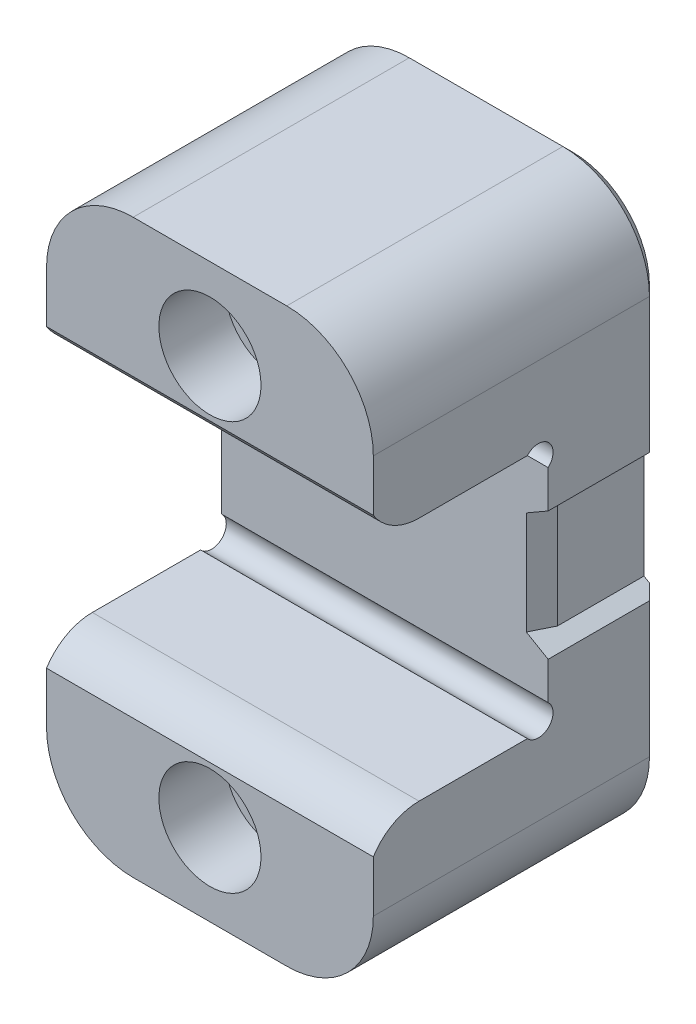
ISO-10303-21;
HEADER;
FILE_DESCRIPTION(('STEP AP214'),'2;1');
FILE_NAME('part.step','',(''),(''),'','','');
FILE_SCHEMA(('AUTOMOTIVE_DESIGN { 1 0 10303 214 1 1 1 1 }'));
ENDSEC;
DATA;
#1=APPLICATION_CONTEXT('core data for automotive mechanical design processes');
#2=APPLICATION_PROTOCOL_DEFINITION('international standard','automotive_design',2000,#1);
#3=PRODUCT_CONTEXT('',#1,'mechanical');
#4=PRODUCT('Part','Part','',(#3));
#5=PRODUCT_RELATED_PRODUCT_CATEGORY('part','',(#4));
#6=PRODUCT_DEFINITION_FORMATION('','',#4);
#7=PRODUCT_DEFINITION_CONTEXT('part definition',#1,'design');
#8=PRODUCT_DEFINITION('design','',#6,#7);
#9=PRODUCT_DEFINITION_SHAPE('','',#8);
#10=(LENGTH_UNIT() NAMED_UNIT(*) SI_UNIT(.MILLI.,.METRE.));
#11=(NAMED_UNIT(*) PLANE_ANGLE_UNIT() SI_UNIT($,.RADIAN.));
#12=(NAMED_UNIT(*) SI_UNIT($,.STERADIAN.) SOLID_ANGLE_UNIT());
#13=UNCERTAINTY_MEASURE_WITH_UNIT(LENGTH_MEASURE(1.E-05),#10,'distance_accuracy_value','');
#14=(GEOMETRIC_REPRESENTATION_CONTEXT(3) GLOBAL_UNCERTAINTY_ASSIGNED_CONTEXT((#13)) GLOBAL_UNIT_ASSIGNED_CONTEXT((#10,
#11,#12)) REPRESENTATION_CONTEXT('',''));
#15=CARTESIAN_POINT('',(0.,0.,0.));
#16=DIRECTION('',(0.,0.,1.));
#17=DIRECTION('',(1.,0.,0.));
#18=AXIS2_PLACEMENT_3D('',#15,#16,#17);
#19=CARTESIAN_POINT('',(25.4,44.45,0.));
#20=DIRECTION('',(0.,0.,-1.));
#21=DIRECTION('',(0.,1.,0.));
#22=AXIS2_PLACEMENT_3D('',#19,#20,#21);
#23=PLANE('',#22);
#24=DIRECTION('',(0.,-1.,0.));
#25=VECTOR('',#24,1.);
#26=CARTESIAN_POINT('',(-25.4,44.45,0.));
#27=LINE('',#26,#25);
#28=CARTESIAN_POINT('',(-25.4,30.988,0.));
#29=VERTEX_POINT('',#28);
#30=CARTESIAN_POINT('',(-25.4,22.995286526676,0.));
#31=VERTEX_POINT('',#30);
#32=EDGE_CURVE('E429',#29,#31,#27,.T.);
#33=ORIENTED_EDGE('',*,*,#32,.T.);
#34=DIRECTION('',(1.,0.,0.));
#35=VECTOR('',#34,1.);
#36=CARTESIAN_POINT('',(-25.4,22.995286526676,0.));
#37=LINE('',#36,#35);
#38=CARTESIAN_POINT('',(25.4,22.995286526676,0.));
#39=VERTEX_POINT('',#38);
#40=EDGE_CURVE('E398',#31,#39,#37,.T.);
#41=ORIENTED_EDGE('',*,*,#40,.T.);
#42=DIRECTION('',(0.,-1.,0.));
#43=VECTOR('',#42,1.);
#44=CARTESIAN_POINT('',(25.4,44.45,0.));
#45=LINE('',#44,#43);
#46=CARTESIAN_POINT('',(25.4,30.988,0.));
#47=VERTEX_POINT('',#46);
#48=EDGE_CURVE('E235',#47,#39,#45,.T.);
#49=ORIENTED_EDGE('',*,*,#48,.F.);
#50=CARTESIAN_POINT('',(11.938,30.988,0.));
#51=DIRECTION('',(0.,0.,-1.));
#52=DIRECTION('',(0.,1.,0.));
#53=AXIS2_PLACEMENT_3D('',#50,#51,#52);
#54=CIRCLE('',#53,13.462);
#55=CARTESIAN_POINT('',(11.938,44.45,0.));
#56=VERTEX_POINT('',#55);
#57=EDGE_CURVE('E265',#47,#56,#54,.F.);
#58=ORIENTED_EDGE('',*,*,#57,.T.);
#59=DIRECTION('',(-1.,0.,0.));
#60=VECTOR('',#59,1.);
#61=CARTESIAN_POINT('',(25.4,44.45,0.));
#62=LINE('',#61,#60);
#63=CARTESIAN_POINT('',(-11.938,44.45,0.));
#64=VERTEX_POINT('',#63);
#65=EDGE_CURVE('E241',#56,#64,#62,.T.);
#66=ORIENTED_EDGE('',*,*,#65,.T.);
#67=CARTESIAN_POINT('',(-11.938,30.988,0.));
#68=DIRECTION('',(0.,0.,-1.));
#69=DIRECTION('',(0.,1.,0.));
#70=AXIS2_PLACEMENT_3D('',#67,#68,#69);
#71=CIRCLE('',#70,13.462);
#72=EDGE_CURVE('E263',#64,#29,#71,.F.);
#73=ORIENTED_EDGE('',*,*,#72,.T.);
#74=EDGE_LOOP('',(#33,#41,#49,#58,#66,#73));
#75=FACE_BOUND('',#74,.T.);
#76=CARTESIAN_POINT('',(0.,31.75,0.));
#77=DIRECTION('',(0.,0.,1.));
#78=DIRECTION('',(1.,0.,0.));
#79=AXIS2_PLACEMENT_3D('',#76,#77,#78);
#80=CIRCLE('',#79,7.9375);
#81=CARTESIAN_POINT('',(7.9375,31.75,0.));
#82=VERTEX_POINT('',#81);
#83=EDGE_CURVE('E372',#82,#82,#80,.T.);
#84=ORIENTED_EDGE('',*,*,#83,.F.);
#85=EDGE_LOOP('',(#84));
#86=FACE_BOUND('',#85,.T.);
#87=ADVANCED_FACE('F32',(#75,#86),#23,.F.);
#88=CARTESIAN_POINT('',(25.4,19.05,-27.178));
#89=DIRECTION('',(0.,0.,-1.));
#90=DIRECTION('',(-1.,0.,0.));
#91=AXIS2_PLACEMENT_3D('',#88,#89,#90);
#92=PLANE('',#91);
#93=DIRECTION('',(0.866025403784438,-0.500000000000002,0.));
#94=VECTOR('',#93,1.);
#95=CARTESIAN_POINT('',(12.8282245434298,-2.72495383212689,-27.178));
#96=LINE('',#95,#94);
#97=CARTESIAN_POINT('',(21.9978635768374,-8.0190473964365,-27.178));
#98=VERTEX_POINT('',#97);
#99=CARTESIAN_POINT('',(25.4,-9.98327177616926,-27.178));
#100=VERTEX_POINT('',#99);
#101=EDGE_CURVE('E427',#98,#100,#96,.T.);
#102=ORIENTED_EDGE('',*,*,#101,.F.);
#103=DIRECTION('',(0.,1.,0.));
#104=VECTOR('',#103,1.);
#105=CARTESIAN_POINT('',(21.9978635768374,8.60845644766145,-27.178));
#106=LINE('',#105,#104);
#107=CARTESIAN_POINT('',(21.9978635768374,8.01904739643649,-27.178));
#108=VERTEX_POINT('',#107);
#109=EDGE_CURVE('E285',#98,#108,#106,.T.);
#110=ORIENTED_EDGE('',*,*,#109,.T.);
#111=DIRECTION('',(-0.866025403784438,-0.500000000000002,0.));
#112=VECTOR('',#111,1.);
#113=CARTESIAN_POINT('',(29.3260084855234,12.249953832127,-27.178));
#114=LINE('',#113,#112);
#115=CARTESIAN_POINT('',(25.4,9.98327177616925,-27.178));
#116=VERTEX_POINT('',#115);
#117=EDGE_CURVE('E425',#116,#108,#114,.T.);
#118=ORIENTED_EDGE('',*,*,#117,.F.);
#119=DIRECTION('',(0.,-1.,0.));
#120=VECTOR('',#119,1.);
#121=CARTESIAN_POINT('',(25.4,19.05,-27.178));
#122=LINE('',#121,#120);
#123=CARTESIAN_POINT('',(25.4,15.8221162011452,-27.178));
#124=VERTEX_POINT('',#123);
#125=EDGE_CURVE('E436',#124,#116,#122,.T.);
#126=ORIENTED_EDGE('',*,*,#125,.F.);
#127=DIRECTION('',(1.,0.,0.));
#128=VECTOR('',#127,1.);
#129=CARTESIAN_POINT('',(-25.4,15.8221162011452,-27.178));
#130=LINE('',#129,#128);
#131=CARTESIAN_POINT('',(-25.4,15.8221162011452,-27.178));
#132=VERTEX_POINT('',#131);
#133=EDGE_CURVE('E391',#124,#132,#130,.F.);
#134=ORIENTED_EDGE('',*,*,#133,.T.);
#135=DIRECTION('',(0.,-1.,0.));
#136=VECTOR('',#135,1.);
#137=CARTESIAN_POINT('',(-25.4,19.05,-27.178));
#138=LINE('',#137,#136);
#139=CARTESIAN_POINT('',(-25.4,-15.8221162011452,-27.178));
#140=VERTEX_POINT('',#139);
#141=EDGE_CURVE('E232',#132,#140,#138,.T.);
#142=ORIENTED_EDGE('',*,*,#141,.T.);
#143=DIRECTION('',(1.,0.,0.));
#144=VECTOR('',#143,1.);
#145=CARTESIAN_POINT('',(-25.4,-15.8221162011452,-27.178));
#146=LINE('',#145,#144);
#147=CARTESIAN_POINT('',(25.4,-15.8221162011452,-27.178));
#148=VERTEX_POINT('',#147);
#149=EDGE_CURVE('E212',#140,#148,#146,.T.);
#150=ORIENTED_EDGE('',*,*,#149,.T.);
#151=EDGE_CURVE('E435',#100,#148,#122,.T.);
#152=ORIENTED_EDGE('',*,*,#151,.F.);
#153=EDGE_LOOP('',(#102,#110,#118,#126,#134,#142,#150,#152));
#154=FACE_BOUND('',#153,.T.);
#155=ADVANCED_FACE('F455',(#154),#92,.F.);
#156=CARTESIAN_POINT('',(25.4,44.45,-44.45));
#157=DIRECTION('',(0.,0.,1.));
#158=DIRECTION('',(1.,0.,0.));
#159=AXIS2_PLACEMENT_3D('',#156,#157,#158);
#160=PLANE('',#159);
#161=DIRECTION('',(0.866025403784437,-0.500000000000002,0.));
#162=VECTOR('',#161,1.);
#163=CARTESIAN_POINT('',(23.01875,-8.60845644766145,-44.45));
#164=LINE('',#163,#162);
#165=CARTESIAN_POINT('',(23.01875,-8.60845644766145,-44.45));
#166=VERTEX_POINT('',#165);
#167=CARTESIAN_POINT('',(23.876,-9.10338996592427,-44.45));
#168=VERTEX_POINT('',#167);
#169=EDGE_CURVE('E415',#166,#168,#164,.T.);
#170=ORIENTED_EDGE('',*,*,#169,.T.);
#171=DIRECTION('',(0.,-1.,0.));
#172=VECTOR('',#171,1.);
#173=CARTESIAN_POINT('',(23.876,44.45,-44.45));
#174=LINE('',#173,#172);
#175=CARTESIAN_POINT('',(23.876,-30.988,-44.45));
#176=VERTEX_POINT('',#175);
#177=EDGE_CURVE('E314',#168,#176,#174,.T.);
#178=ORIENTED_EDGE('',*,*,#177,.T.);
#179=CARTESIAN_POINT('',(11.938,-30.988,-44.45));
#180=DIRECTION('',(0.,0.,1.));
#181=DIRECTION('',(1.,0.,0.));
#182=AXIS2_PLACEMENT_3D('',#179,#180,#181);
#183=CIRCLE('',#182,11.938);
#184=CARTESIAN_POINT('',(11.938,-42.926,-44.45));
#185=VERTEX_POINT('',#184);
#186=EDGE_CURVE('E310',#176,#185,#183,.F.);
#187=ORIENTED_EDGE('',*,*,#186,.T.);
#188=DIRECTION('',(-1.,0.,0.));
#189=VECTOR('',#188,1.);
#190=CARTESIAN_POINT('',(25.4,-42.926,-44.45));
#191=LINE('',#190,#189);
#192=CARTESIAN_POINT('',(-11.938,-42.926,-44.45));
#193=VERTEX_POINT('',#192);
#194=EDGE_CURVE('E306',#185,#193,#191,.T.);
#195=ORIENTED_EDGE('',*,*,#194,.T.);
#196=CARTESIAN_POINT('',(-11.938,-30.988,-44.45));
#197=DIRECTION('',(0.,0.,1.));
#198=DIRECTION('',(1.,0.,0.));
#199=AXIS2_PLACEMENT_3D('',#196,#197,#198);
#200=CIRCLE('',#199,11.938);
#201=CARTESIAN_POINT('',(-23.876,-30.988,-44.45));
#202=VERTEX_POINT('',#201);
#203=EDGE_CURVE('E304',#193,#202,#200,.F.);
#204=ORIENTED_EDGE('',*,*,#203,.T.);
#205=DIRECTION('',(0.,1.,0.));
#206=VECTOR('',#205,1.);
#207=CARTESIAN_POINT('',(-23.876,30.988,-44.45));
#208=LINE('',#207,#206);
#209=CARTESIAN_POINT('',(-23.876,30.988,-44.45));
#210=VERTEX_POINT('',#209);
#211=EDGE_CURVE('E300',#202,#210,#208,.T.);
#212=ORIENTED_EDGE('',*,*,#211,.T.);
#213=CARTESIAN_POINT('',(-11.938,30.988,-44.45));
#214=DIRECTION('',(0.,0.,1.));
#215=DIRECTION('',(1.,0.,0.));
#216=AXIS2_PLACEMENT_3D('',#213,#214,#215);
#217=CIRCLE('',#216,11.938);
#218=CARTESIAN_POINT('',(-11.938,42.926,-44.45));
#219=VERTEX_POINT('',#218);
#220=EDGE_CURVE('E298',#210,#219,#217,.F.);
#221=ORIENTED_EDGE('',*,*,#220,.T.);
#222=DIRECTION('',(1.,0.,0.));
#223=VECTOR('',#222,1.);
#224=CARTESIAN_POINT('',(25.4,42.926,-44.45));
#225=LINE('',#224,#223);
#226=CARTESIAN_POINT('',(11.938,42.926,-44.45));
#227=VERTEX_POINT('',#226);
#228=EDGE_CURVE('E302',#219,#227,#225,.T.);
#229=ORIENTED_EDGE('',*,*,#228,.T.);
#230=CARTESIAN_POINT('',(11.938,30.988,-44.45));
#231=DIRECTION('',(0.,0.,1.));
#232=DIRECTION('',(1.,0.,0.));
#233=AXIS2_PLACEMENT_3D('',#230,#231,#232);
#234=CIRCLE('',#233,11.938);
#235=CARTESIAN_POINT('',(23.876,30.988,-44.45));
#236=VERTEX_POINT('',#235);
#237=EDGE_CURVE('E308',#227,#236,#234,.F.);
#238=ORIENTED_EDGE('',*,*,#237,.T.);
#239=DIRECTION('',(0.,-1.,0.));
#240=VECTOR('',#239,1.);
#241=CARTESIAN_POINT('',(23.876,44.45,-44.45));
#242=LINE('',#241,#240);
#243=CARTESIAN_POINT('',(23.876,9.10338996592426,-44.45));
#244=VERTEX_POINT('',#243);
#245=EDGE_CURVE('E312',#236,#244,#242,.T.);
#246=ORIENTED_EDGE('',*,*,#245,.T.);
#247=DIRECTION('',(-0.866025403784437,-0.500000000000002,0.));
#248=VECTOR('',#247,1.);
#249=CARTESIAN_POINT('',(23.01875,8.60845644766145,-44.45));
#250=LINE('',#249,#248);
#251=CARTESIAN_POINT('',(23.01875,8.60845644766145,-44.45));
#252=VERTEX_POINT('',#251);
#253=EDGE_CURVE('E418',#244,#252,#250,.T.);
#254=ORIENTED_EDGE('',*,*,#253,.T.);
#255=DIRECTION('',(0.,-1.,0.));
#256=VECTOR('',#255,1.);
#257=CARTESIAN_POINT('',(23.01875,8.60845644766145,-44.45));
#258=LINE('',#257,#256);
#259=EDGE_CURVE('E411',#252,#166,#258,.T.);
#260=ORIENTED_EDGE('',*,*,#259,.T.);
#261=EDGE_LOOP('',(#170,#178,#187,#195,#204,#212,#221,#229,#238,#246,#254,#260));
#262=FACE_BOUND('',#261,.T.);
#263=CARTESIAN_POINT('',(0.,31.75,-44.45));
#264=DIRECTION('',(0.,0.,1.));
#265=DIRECTION('',(1.,0.,0.));
#266=AXIS2_PLACEMENT_3D('',#263,#264,#265);
#267=CIRCLE('',#266,5.35812999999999);
#268=CARTESIAN_POINT('',(5.35812999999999,31.75,-44.45));
#269=VERTEX_POINT('',#268);
#270=EDGE_CURVE('E359',#269,#269,#267,.T.);
#271=ORIENTED_EDGE('',*,*,#270,.T.);
#272=EDGE_LOOP('',(#271));
#273=FACE_BOUND('',#272,.T.);
#274=CARTESIAN_POINT('',(0.,-31.75,-44.45));
#275=DIRECTION('',(0.,0.,1.));
#276=DIRECTION('',(1.,0.,0.));
#277=AXIS2_PLACEMENT_3D('',#274,#275,#276);
#278=CIRCLE('',#277,5.35812999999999);
#279=CARTESIAN_POINT('',(5.35812999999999,-31.75,-44.45));
#280=VERTEX_POINT('',#279);
#281=EDGE_CURVE('E369',#280,#280,#278,.T.);
#282=ORIENTED_EDGE('',*,*,#281,.T.);
#283=EDGE_LOOP('',(#282));
#284=FACE_BOUND('',#283,.T.);
#285=ADVANCED_FACE('F550',(#262,#273,#284),#160,.F.);
#286=CARTESIAN_POINT('',(25.4,-19.05,0.));
#287=DIRECTION('',(-1.,0.,0.));
#288=DIRECTION('',(0.,0.,1.));
#289=AXIS2_PLACEMENT_3D('',#286,#287,#288);
#290=PLANE('',#289);
#291=DIRECTION('',(0.,0.,-1.));
#292=VECTOR('',#291,1.);
#293=CARTESIAN_POINT('',(25.4,-30.988,0.));
#294=LINE('',#293,#292);
#295=CARTESIAN_POINT('',(25.4,-30.988,0.));
#296=VERTEX_POINT('',#295);
#297=CARTESIAN_POINT('',(25.4,-30.988,-42.926));
#298=VERTEX_POINT('',#297);
#299=EDGE_CURVE('E250',#296,#298,#294,.T.);
#300=ORIENTED_EDGE('',*,*,#299,.T.);
#301=DIRECTION('',(0.,1.,0.));
#302=VECTOR('',#301,1.);
#303=CARTESIAN_POINT('',(25.4,-19.05,-42.926));
#304=LINE('',#303,#302);
#305=CARTESIAN_POINT('',(25.4,-9.98327177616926,-42.926));
#306=VERTEX_POINT('',#305);
#307=EDGE_CURVE('E293',#298,#306,#304,.T.);
#308=ORIENTED_EDGE('',*,*,#307,.T.);
#309=DIRECTION('',(0.,0.,-1.));
#310=VECTOR('',#309,1.);
#311=CARTESIAN_POINT('',(25.4,-9.98327177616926,0.));
#312=LINE('',#311,#310);
#313=EDGE_CURVE('E277',#100,#306,#312,.T.);
#314=ORIENTED_EDGE('',*,*,#313,.F.);
#315=ORIENTED_EDGE('',*,*,#151,.T.);
#316=CARTESIAN_POINT('',(25.4,-17.526,-25.654));
#317=DIRECTION('',(1.,0.,0.));
#318=DIRECTION('',(0.,0.,1.));
#319=AXIS2_PLACEMENT_3D('',#316,#317,#318);
#320=CIRCLE('',#319,2.286);
#321=CARTESIAN_POINT('',(25.4,-19.05,-23.9501162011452));
#322=VERTEX_POINT('',#321);
#323=EDGE_CURVE('E217',#322,#148,#320,.T.);
#324=ORIENTED_EDGE('',*,*,#323,.F.);
#325=DIRECTION('',(0.,0.,1.));
#326=VECTOR('',#325,1.);
#327=CARTESIAN_POINT('',(25.4,-19.05,-27.178));
#328=LINE('',#327,#326);
#329=CARTESIAN_POINT('',(25.4,-19.05,-7.11199999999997));
#330=VERTEX_POINT('',#329);
#331=EDGE_CURVE('E225',#322,#330,#328,.T.);
#332=ORIENTED_EDGE('',*,*,#331,.T.);
#333=CARTESIAN_POINT('',(25.4,-27.4328930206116,-7.11199999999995));
#334=DIRECTION('',(-1.,0.,0.));
#335=DIRECTION('',(0.,0.,1.));
#336=AXIS2_PLACEMENT_3D('',#333,#334,#335);
#337=CIRCLE('',#336,8.38289302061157);
#338=CARTESIAN_POINT('',(25.4,-22.995286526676,0.));
#339=VERTEX_POINT('',#338);
#340=EDGE_CURVE('E402',#339,#330,#337,.T.);
#341=ORIENTED_EDGE('',*,*,#340,.F.);
#342=DIRECTION('',(0.,-1.,0.));
#343=VECTOR('',#342,1.);
#344=CARTESIAN_POINT('',(25.4,-19.05,0.));
#345=LINE('',#344,#343);
#346=EDGE_CURVE('E245',#339,#296,#345,.T.);
#347=ORIENTED_EDGE('',*,*,#346,.T.);
#348=EDGE_LOOP('',(#300,#308,#314,#315,#324,#332,#341,#347));
#349=FACE_BOUND('',#348,.T.);
#350=ADVANCED_FACE('F523',(#349),#290,.F.);
#351=DIRECTION('',(0.,0.,1.));
#352=VECTOR('',#351,1.);
#353=CARTESIAN_POINT('',(25.4,9.98327177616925,0.));
#354=LINE('',#353,#352);
#355=CARTESIAN_POINT('',(25.4,9.98327177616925,-42.926));
#356=VERTEX_POINT('',#355);
#357=EDGE_CURVE('E275',#356,#116,#354,.T.);
#358=ORIENTED_EDGE('',*,*,#357,.F.);
#359=DIRECTION('',(0.,1.,0.));
#360=VECTOR('',#359,1.);
#361=CARTESIAN_POINT('',(25.4,-19.05,-42.926));
#362=LINE('',#361,#360);
#363=CARTESIAN_POINT('',(25.4,30.988,-42.926));
#364=VERTEX_POINT('',#363);
#365=EDGE_CURVE('E316',#356,#364,#362,.T.);
#366=ORIENTED_EDGE('',*,*,#365,.T.);
#367=DIRECTION('',(0.,0.,1.));
#368=VECTOR('',#367,1.);
#369=CARTESIAN_POINT('',(25.4,30.988,0.));
#370=LINE('',#369,#368);
#371=EDGE_CURVE('E248',#364,#47,#370,.T.);
#372=ORIENTED_EDGE('',*,*,#371,.T.);
#373=ORIENTED_EDGE('',*,*,#48,.T.);
#374=CARTESIAN_POINT('',(25.4,27.4328930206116,-7.11199999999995));
#375=DIRECTION('',(-1.,0.,0.));
#376=DIRECTION('',(0.,0.,-1.));
#377=AXIS2_PLACEMENT_3D('',#374,#375,#376);
#378=CIRCLE('',#377,8.38289302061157);
#379=CARTESIAN_POINT('',(25.4,19.05,-7.11199999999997));
#380=VERTEX_POINT('',#379);
#381=EDGE_CURVE('E394',#380,#39,#378,.T.);
#382=ORIENTED_EDGE('',*,*,#381,.F.);
#383=DIRECTION('',(0.,0.,-1.));
#384=VECTOR('',#383,1.);
#385=CARTESIAN_POINT('',(25.4,19.05,0.));
#386=LINE('',#385,#384);
#387=CARTESIAN_POINT('',(25.4,19.05,-23.9501162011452));
#388=VERTEX_POINT('',#387);
#389=EDGE_CURVE('E432',#380,#388,#386,.T.);
#390=ORIENTED_EDGE('',*,*,#389,.T.);
#391=CARTESIAN_POINT('',(25.4,17.526,-25.654));
#392=DIRECTION('',(1.,0.,0.));
#393=DIRECTION('',(0.,0.,-1.));
#394=AXIS2_PLACEMENT_3D('',#391,#392,#393);
#395=CIRCLE('',#394,2.286);
#396=EDGE_CURVE('E386',#124,#388,#395,.T.);
#397=ORIENTED_EDGE('',*,*,#396,.F.);
#398=ORIENTED_EDGE('',*,*,#125,.T.);
#399=EDGE_LOOP('',(#358,#366,#372,#373,#382,#390,#397,#398));
#400=FACE_BOUND('',#399,.T.);
#401=ADVANCED_FACE('F459',(#400),#290,.F.);
#402=CARTESIAN_POINT('',(25.4,19.05,0.));
#403=DIRECTION('',(0.,1.,0.));
#404=DIRECTION('',(0.,0.,1.));
#405=AXIS2_PLACEMENT_3D('',#402,#403,#404);
#406=PLANE('',#405);
#407=DIRECTION('',(0.,0.,-1.));
#408=VECTOR('',#407,1.);
#409=CARTESIAN_POINT('',(-25.4,19.05,0.));
#410=LINE('',#409,#408);
#411=CARTESIAN_POINT('',(-25.4,19.05,-7.11199999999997));
#412=VERTEX_POINT('',#411);
#413=CARTESIAN_POINT('',(-25.4,19.05,-23.9501162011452));
#414=VERTEX_POINT('',#413);
#415=EDGE_CURVE('E237',#412,#414,#410,.T.);
#416=ORIENTED_EDGE('',*,*,#415,.T.);
#417=DIRECTION('',(1.,0.,0.));
#418=VECTOR('',#417,1.);
#419=CARTESIAN_POINT('',(-25.4,19.05,-23.9501162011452));
#420=LINE('',#419,#418);
#421=EDGE_CURVE('E388',#414,#388,#420,.T.);
#422=ORIENTED_EDGE('',*,*,#421,.T.);
#423=ORIENTED_EDGE('',*,*,#389,.F.);
#424=DIRECTION('',(1.,0.,0.));
#425=VECTOR('',#424,1.);
#426=CARTESIAN_POINT('',(-25.4,19.05,-7.11199999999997));
#427=LINE('',#426,#425);
#428=EDGE_CURVE('E400',#412,#380,#427,.T.);
#429=ORIENTED_EDGE('',*,*,#428,.F.);
#430=EDGE_LOOP('',(#416,#422,#423,#429));
#431=FACE_BOUND('',#430,.T.);
#432=ADVANCED_FACE('F446',(#431),#406,.F.);
#433=CARTESIAN_POINT('',(25.4,-19.05,-27.178));
#434=DIRECTION('',(0.,-1.,0.));
#435=DIRECTION('',(0.,0.,-1.));
#436=AXIS2_PLACEMENT_3D('',#433,#434,#435);
#437=PLANE('',#436);
#438=ORIENTED_EDGE('',*,*,#331,.F.);
#439=DIRECTION('',(1.,0.,0.));
#440=VECTOR('',#439,1.);
#441=CARTESIAN_POINT('',(-25.4,-19.05,-23.9501162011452));
#442=LINE('',#441,#440);
#443=CARTESIAN_POINT('',(-25.4,-19.05,-23.9501162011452));
#444=VERTEX_POINT('',#443);
#445=EDGE_CURVE('E209',#322,#444,#442,.F.);
#446=ORIENTED_EDGE('',*,*,#445,.T.);
#447=DIRECTION('',(0.,0.,1.));
#448=VECTOR('',#447,1.);
#449=CARTESIAN_POINT('',(-25.4,-19.05,-27.178));
#450=LINE('',#449,#448);
#451=CARTESIAN_POINT('',(-25.4,-19.05,-7.11199999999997));
#452=VERTEX_POINT('',#451);
#453=EDGE_CURVE('E223',#444,#452,#450,.T.);
#454=ORIENTED_EDGE('',*,*,#453,.T.);
#455=DIRECTION('',(1.,0.,0.));
#456=VECTOR('',#455,1.);
#457=CARTESIAN_POINT('',(-25.4,-19.05,-7.11199999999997));
#458=LINE('',#457,#456);
#459=EDGE_CURVE('E406',#452,#330,#458,.T.);
#460=ORIENTED_EDGE('',*,*,#459,.T.);
#461=EDGE_LOOP('',(#438,#446,#454,#460));
#462=FACE_BOUND('',#461,.T.);
#463=ADVANCED_FACE('F221',(#462),#437,.F.);
#464=CARTESIAN_POINT('',(25.4,-19.05,0.));
#465=DIRECTION('',(0.,0.,-1.));
#466=DIRECTION('',(0.,1.,0.));
#467=AXIS2_PLACEMENT_3D('',#464,#465,#466);
#468=PLANE('',#467);
#469=CARTESIAN_POINT('',(0.,-31.75,0.));
#470=DIRECTION('',(0.,0.,1.));
#471=DIRECTION('',(1.,0.,0.));
#472=AXIS2_PLACEMENT_3D('',#469,#470,#471);
#473=CIRCLE('',#472,7.9375);
#474=CARTESIAN_POINT('',(7.9375,-31.75,0.));
#475=VERTEX_POINT('',#474);
#476=EDGE_CURVE('E378',#475,#475,#473,.T.);
#477=ORIENTED_EDGE('',*,*,#476,.F.);
#478=EDGE_LOOP('',(#477));
#479=FACE_BOUND('',#478,.T.);
#480=ORIENTED_EDGE('',*,*,#346,.F.);
#481=DIRECTION('',(1.,0.,0.));
#482=VECTOR('',#481,1.);
#483=CARTESIAN_POINT('',(-25.4,-22.995286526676,0.));
#484=LINE('',#483,#482);
#485=CARTESIAN_POINT('',(-25.4,-22.995286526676,0.));
#486=VERTEX_POINT('',#485);
#487=EDGE_CURVE('E409',#486,#339,#484,.T.);
#488=ORIENTED_EDGE('',*,*,#487,.F.);
#489=DIRECTION('',(0.,-1.,0.));
#490=VECTOR('',#489,1.);
#491=CARTESIAN_POINT('',(-25.4,-19.05,0.));
#492=LINE('',#491,#490);
#493=CARTESIAN_POINT('',(-25.4,-30.988,0.));
#494=VERTEX_POINT('',#493);
#495=EDGE_CURVE('E231',#486,#494,#492,.T.);
#496=ORIENTED_EDGE('',*,*,#495,.T.);
#497=CARTESIAN_POINT('',(-11.938,-30.988,0.));
#498=DIRECTION('',(0.,0.,-1.));
#499=DIRECTION('',(0.,1.,0.));
#500=AXIS2_PLACEMENT_3D('',#497,#498,#499);
#501=CIRCLE('',#500,13.462);
#502=CARTESIAN_POINT('',(-11.938,-44.45,0.));
#503=VERTEX_POINT('',#502);
#504=EDGE_CURVE('E258',#494,#503,#501,.F.);
#505=ORIENTED_EDGE('',*,*,#504,.T.);
#506=DIRECTION('',(-1.,0.,0.));
#507=VECTOR('',#506,1.);
#508=CARTESIAN_POINT('',(25.4,-44.45,0.));
#509=LINE('',#508,#507);
#510=CARTESIAN_POINT('',(11.938,-44.45,0.));
#511=VERTEX_POINT('',#510);
#512=EDGE_CURVE('E244',#511,#503,#509,.T.);
#513=ORIENTED_EDGE('',*,*,#512,.F.);
#514=CARTESIAN_POINT('',(11.938,-30.988,0.));
#515=DIRECTION('',(0.,0.,-1.));
#516=DIRECTION('',(0.,1.,0.));
#517=AXIS2_PLACEMENT_3D('',#514,#515,#516);
#518=CIRCLE('',#517,13.462);
#519=EDGE_CURVE('E260',#511,#296,#518,.F.);
#520=ORIENTED_EDGE('',*,*,#519,.T.);
#521=EDGE_LOOP('',(#480,#488,#496,#505,#513,#520));
#522=FACE_BOUND('',#521,.T.);
#523=ADVANCED_FACE('F497',(#479,#522),#468,.F.);
#524=CARTESIAN_POINT('',(25.4,-44.45,0.));
#525=DIRECTION('',(0.,1.,0.));
#526=DIRECTION('',(0.,0.,1.));
#527=AXIS2_PLACEMENT_3D('',#524,#525,#526);
#528=PLANE('',#527);
#529=DIRECTION('',(0.,0.,-1.));
#530=VECTOR('',#529,1.);
#531=CARTESIAN_POINT('',(-11.938,-44.45,-44.45));
#532=LINE('',#531,#530);
#533=CARTESIAN_POINT('',(-11.938,-44.45,-42.926));
#534=VERTEX_POINT('',#533);
#535=EDGE_CURVE('E253',#503,#534,#532,.T.);
#536=ORIENTED_EDGE('',*,*,#535,.T.);
#537=DIRECTION('',(1.,0.,0.));
#538=VECTOR('',#537,1.);
#539=CARTESIAN_POINT('',(25.4,-44.45,-42.926));
#540=LINE('',#539,#538);
#541=CARTESIAN_POINT('',(11.938,-44.45,-42.926));
#542=VERTEX_POINT('',#541);
#543=EDGE_CURVE('E324',#534,#542,#540,.T.);
#544=ORIENTED_EDGE('',*,*,#543,.T.);
#545=DIRECTION('',(0.,0.,-1.));
#546=VECTOR('',#545,1.);
#547=CARTESIAN_POINT('',(11.938,-44.45,0.));
#548=LINE('',#547,#546);
#549=EDGE_CURVE('E256',#542,#511,#548,.F.);
#550=ORIENTED_EDGE('',*,*,#549,.T.);
#551=ORIENTED_EDGE('',*,*,#512,.T.);
#552=EDGE_LOOP('',(#536,#544,#550,#551));
#553=FACE_BOUND('',#552,.T.);
#554=ADVANCED_FACE('F501',(#553),#528,.F.);
#555=CARTESIAN_POINT('',(25.4,44.45,0.));
#556=DIRECTION('',(0.,-1.,0.));
#557=DIRECTION('',(0.,0.,-1.));
#558=AXIS2_PLACEMENT_3D('',#555,#556,#557);
#559=PLANE('',#558);
#560=DIRECTION('',(0.,0.,1.));
#561=VECTOR('',#560,1.);
#562=CARTESIAN_POINT('',(11.938,44.45,0.));
#563=LINE('',#562,#561);
#564=CARTESIAN_POINT('',(11.938,44.45,-42.926));
#565=VERTEX_POINT('',#564);
#566=EDGE_CURVE('E269',#56,#565,#563,.F.);
#567=ORIENTED_EDGE('',*,*,#566,.T.);
#568=DIRECTION('',(-1.,0.,0.));
#569=VECTOR('',#568,1.);
#570=CARTESIAN_POINT('',(25.4,44.45,-42.926));
#571=LINE('',#570,#569);
#572=CARTESIAN_POINT('',(-11.938,44.45,-42.926));
#573=VERTEX_POINT('',#572);
#574=EDGE_CURVE('E55',#565,#573,#571,.T.);
#575=ORIENTED_EDGE('',*,*,#574,.T.);
#576=DIRECTION('',(0.,0.,1.));
#577=VECTOR('',#576,1.);
#578=CARTESIAN_POINT('',(-11.938,44.45,0.));
#579=LINE('',#578,#577);
#580=EDGE_CURVE('E267',#573,#64,#579,.T.);
#581=ORIENTED_EDGE('',*,*,#580,.T.);
#582=ORIENTED_EDGE('',*,*,#65,.F.);
#583=EDGE_LOOP('',(#567,#575,#581,#582));
#584=FACE_BOUND('',#583,.T.);
#585=ADVANCED_FACE('F474',(#584),#559,.F.);
#586=CARTESIAN_POINT('',(-25.4,-19.05,0.));
#587=DIRECTION('',(-1.,0.,0.));
#588=DIRECTION('',(0.,0.,1.));
#589=AXIS2_PLACEMENT_3D('',#586,#587,#588);
#590=PLANE('',#589);
#591=DIRECTION('',(0.,0.,1.));
#592=VECTOR('',#591,1.);
#593=CARTESIAN_POINT('',(-25.4,30.988,-44.45));
#594=LINE('',#593,#592);
#595=CARTESIAN_POINT('',(-25.4,30.988,-42.926));
#596=VERTEX_POINT('',#595);
#597=EDGE_CURVE('E271',#29,#596,#594,.F.);
#598=ORIENTED_EDGE('',*,*,#597,.T.);
#599=DIRECTION('',(0.,-1.,0.));
#600=VECTOR('',#599,1.);
#601=CARTESIAN_POINT('',(-25.4,-30.988,-42.926));
#602=LINE('',#601,#600);
#603=CARTESIAN_POINT('',(-25.4,-30.988,-42.926));
#604=VERTEX_POINT('',#603);
#605=EDGE_CURVE('E41',#596,#604,#602,.T.);
#606=ORIENTED_EDGE('',*,*,#605,.T.);
#607=DIRECTION('',(0.,0.,-1.));
#608=VECTOR('',#607,1.);
#609=CARTESIAN_POINT('',(-25.4,-30.988,0.));
#610=LINE('',#609,#608);
#611=EDGE_CURVE('E273',#604,#494,#610,.F.);
#612=ORIENTED_EDGE('',*,*,#611,.T.);
#613=ORIENTED_EDGE('',*,*,#495,.F.);
#614=CARTESIAN_POINT('',(-25.4,-27.4328930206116,-7.11199999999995));
#615=DIRECTION('',(-1.,0.,0.));
#616=DIRECTION('',(0.,0.,1.));
#617=AXIS2_PLACEMENT_3D('',#614,#615,#616);
#618=CIRCLE('',#617,8.38289302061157);
#619=EDGE_CURVE('E230',#486,#452,#618,.T.);
#620=ORIENTED_EDGE('',*,*,#619,.T.);
#621=ORIENTED_EDGE('',*,*,#453,.F.);
#622=CARTESIAN_POINT('',(-25.4,-17.526,-25.654));
#623=DIRECTION('',(1.,0.,0.));
#624=DIRECTION('',(0.,0.,1.));
#625=AXIS2_PLACEMENT_3D('',#622,#623,#624);
#626=CIRCLE('',#625,2.286);
#627=EDGE_CURVE('E206',#444,#140,#626,.T.);
#628=ORIENTED_EDGE('',*,*,#627,.T.);
#629=ORIENTED_EDGE('',*,*,#141,.F.);
#630=CARTESIAN_POINT('',(-25.4,17.526,-25.654));
#631=DIRECTION('',(-1.,0.,0.));
#632=DIRECTION('',(0.,0.,1.));
#633=AXIS2_PLACEMENT_3D('',#630,#631,#632);
#634=CIRCLE('',#633,2.286);
#635=EDGE_CURVE('E280',#414,#132,#634,.T.);
#636=ORIENTED_EDGE('',*,*,#635,.F.);
#637=ORIENTED_EDGE('',*,*,#415,.F.);
#638=CARTESIAN_POINT('',(-25.4,27.4328930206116,-7.11199999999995));
#639=DIRECTION('',(-1.,0.,0.));
#640=DIRECTION('',(0.,0.,-1.));
#641=AXIS2_PLACEMENT_3D('',#638,#639,#640);
#642=CIRCLE('',#641,8.38289302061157);
#643=EDGE_CURVE('E395',#412,#31,#642,.T.);
#644=ORIENTED_EDGE('',*,*,#643,.T.);
#645=ORIENTED_EDGE('',*,*,#32,.F.);
#646=EDGE_LOOP('',(#598,#606,#612,#613,#620,#621,#628,#629,#636,#637,#644,#645));
#647=FACE_BOUND('',#646,.T.);
#648=ADVANCED_FACE('F228',(#647),#590,.T.);
#649=CARTESIAN_POINT('',(11.938,-30.988,0.));
#650=DIRECTION('',(0.,0.,-1.));
#651=DIRECTION('',(-1.,0.,0.));
#652=AXIS2_PLACEMENT_3D('',#649,#650,#651);
#653=CYLINDRICAL_SURFACE('',#652,13.462);
#654=ORIENTED_EDGE('',*,*,#549,.F.);
#655=CARTESIAN_POINT('',(11.938,-30.988,-42.926));
#656=DIRECTION('',(0.,0.,1.));
#657=DIRECTION('',(1.,0.,0.));
#658=AXIS2_PLACEMENT_3D('',#655,#656,#657);
#659=CIRCLE('',#658,13.462);
#660=EDGE_CURVE('E320',#542,#298,#659,.T.);
#661=ORIENTED_EDGE('',*,*,#660,.T.);
#662=ORIENTED_EDGE('',*,*,#299,.F.);
#663=ORIENTED_EDGE('',*,*,#519,.F.);
#664=EDGE_LOOP('',(#654,#661,#662,#663));
#665=FACE_BOUND('',#664,.T.);
#666=ADVANCED_FACE('F507',(#665),#653,.T.);
#667=CARTESIAN_POINT('',(11.938,30.988,0.));
#668=DIRECTION('',(0.,0.,1.));
#669=DIRECTION('',(1.,0.,0.));
#670=AXIS2_PLACEMENT_3D('',#667,#668,#669);
#671=CYLINDRICAL_SURFACE('',#670,13.462);
#672=ORIENTED_EDGE('',*,*,#371,.F.);
#673=CARTESIAN_POINT('',(11.938,30.988,-42.926));
#674=DIRECTION('',(0.,0.,1.));
#675=DIRECTION('',(1.,0.,0.));
#676=AXIS2_PLACEMENT_3D('',#673,#674,#675);
#677=CIRCLE('',#676,13.462);
#678=EDGE_CURVE('E322',#364,#565,#677,.T.);
#679=ORIENTED_EDGE('',*,*,#678,.T.);
#680=ORIENTED_EDGE('',*,*,#566,.F.);
#681=ORIENTED_EDGE('',*,*,#57,.F.);
#682=EDGE_LOOP('',(#672,#679,#680,#681));
#683=FACE_BOUND('',#682,.T.);
#684=ADVANCED_FACE('F477',(#683),#671,.T.);
#685=CARTESIAN_POINT('',(-11.938,-30.988,0.));
#686=DIRECTION('',(0.,0.,1.));
#687=DIRECTION('',(1.,0.,0.));
#688=AXIS2_PLACEMENT_3D('',#685,#686,#687);
#689=CYLINDRICAL_SURFACE('',#688,13.462);
#690=ORIENTED_EDGE('',*,*,#611,.F.);
#691=CARTESIAN_POINT('',(-11.938,-30.988,-42.926));
#692=DIRECTION('',(0.,0.,1.));
#693=DIRECTION('',(1.,0.,0.));
#694=AXIS2_PLACEMENT_3D('',#691,#692,#693);
#695=CIRCLE('',#694,13.462);
#696=EDGE_CURVE('E326',#604,#534,#695,.T.);
#697=ORIENTED_EDGE('',*,*,#696,.T.);
#698=ORIENTED_EDGE('',*,*,#535,.F.);
#699=ORIENTED_EDGE('',*,*,#504,.F.);
#700=EDGE_LOOP('',(#690,#697,#698,#699));
#701=FACE_BOUND('',#700,.T.);
#702=ADVANCED_FACE('F492',(#701),#689,.T.);
#703=CARTESIAN_POINT('',(-11.938,30.988,0.));
#704=DIRECTION('',(0.,0.,-1.));
#705=DIRECTION('',(-1.,0.,0.));
#706=AXIS2_PLACEMENT_3D('',#703,#704,#705);
#707=CYLINDRICAL_SURFACE('',#706,13.462);
#708=ORIENTED_EDGE('',*,*,#580,.F.);
#709=CARTESIAN_POINT('',(-11.938,30.988,-42.926));
#710=DIRECTION('',(0.,0.,1.));
#711=DIRECTION('',(1.,0.,0.));
#712=AXIS2_PLACEMENT_3D('',#709,#710,#711);
#713=CIRCLE('',#712,13.462);
#714=EDGE_CURVE('E11',#573,#596,#713,.T.);
#715=ORIENTED_EDGE('',*,*,#714,.T.);
#716=ORIENTED_EDGE('',*,*,#597,.F.);
#717=ORIENTED_EDGE('',*,*,#72,.F.);
#718=EDGE_LOOP('',(#708,#715,#716,#717));
#719=FACE_BOUND('',#718,.T.);
#720=ADVANCED_FACE('F469',(#719),#707,.T.);
#721=CARTESIAN_POINT('',(23.01875,8.60845644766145,0.));
#722=DIRECTION('',(1.,0.,0.));
#723=DIRECTION('',(0.,0.,-1.));
#724=AXIS2_PLACEMENT_3D('',#721,#722,#723);
#725=PLANE('',#724);
#726=DIRECTION('',(0.,0.,-1.));
#727=VECTOR('',#726,1.);
#728=CARTESIAN_POINT('',(23.01875,8.60845644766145,0.));
#729=LINE('',#728,#727);
#730=CARTESIAN_POINT('',(23.01875,8.60845644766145,-30.9880000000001));
#731=VERTEX_POINT('',#730);
#732=EDGE_CURVE('E420',#731,#252,#729,.T.);
#733=ORIENTED_EDGE('',*,*,#732,.F.);
#734=DIRECTION('',(0.,-1.,0.));
#735=VECTOR('',#734,1.);
#736=CARTESIAN_POINT('',(23.01875,-8.60845644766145,-30.9880000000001));
#737=LINE('',#736,#735);
#738=CARTESIAN_POINT('',(23.01875,-8.60845644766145,-30.9880000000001));
#739=VERTEX_POINT('',#738);
#740=EDGE_CURVE('E282',#731,#739,#737,.T.);
#741=ORIENTED_EDGE('',*,*,#740,.T.);
#742=DIRECTION('',(0.,0.,-1.));
#743=VECTOR('',#742,1.);
#744=CARTESIAN_POINT('',(23.01875,-8.60845644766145,0.));
#745=LINE('',#744,#743);
#746=EDGE_CURVE('E423',#739,#166,#745,.T.);
#747=ORIENTED_EDGE('',*,*,#746,.T.);
#748=ORIENTED_EDGE('',*,*,#259,.F.);
#749=EDGE_LOOP('',(#733,#741,#747,#748));
#750=FACE_BOUND('',#749,.T.);
#751=ADVANCED_FACE('F562',(#750),#725,.T.);
#752=CARTESIAN_POINT('',(23.01875,-8.60845644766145,0.));
#753=DIRECTION('',(0.500000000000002,0.866025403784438,0.));
#754=DIRECTION('',(-0.866025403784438,0.500000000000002,0.));
#755=AXIS2_PLACEMENT_3D('',#752,#753,#754);
#756=PLANE('',#755);
#757=ORIENTED_EDGE('',*,*,#313,.T.);
#758=DIRECTION('',(0.654653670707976,-0.377964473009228,0.654653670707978));
#759=VECTOR('',#758,1.);
#760=CARTESIAN_POINT('',(42.4361428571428,-19.8190934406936,-25.8898571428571));
#761=LINE('',#760,#759);
#762=EDGE_CURVE('E296',#306,#168,#761,.F.);
#763=ORIENTED_EDGE('',*,*,#762,.T.);
#764=ORIENTED_EDGE('',*,*,#169,.F.);
#765=ORIENTED_EDGE('',*,*,#746,.F.);
#766=DIRECTION('',(-0.255976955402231,0.14778836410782,0.955319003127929));
#767=VECTOR('',#766,1.);
#768=CARTESIAN_POINT('',(22.3674270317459,-8.23241495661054,-28.557229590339));
#769=LINE('',#768,#767);
#770=EDGE_CURVE('E288',#739,#98,#769,.T.);
#771=ORIENTED_EDGE('',*,*,#770,.T.);
#772=ORIENTED_EDGE('',*,*,#101,.T.);
#773=EDGE_LOOP('',(#757,#763,#764,#765,#771,#772));
#774=FACE_BOUND('',#773,.T.);
#775=ADVANCED_FACE('F527',(#774),#756,.T.);
#776=CARTESIAN_POINT('',(23.01875,8.60845644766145,0.));
#777=DIRECTION('',(0.500000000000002,-0.866025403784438,0.));
#778=DIRECTION('',(0.866025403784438,0.500000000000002,0.));
#779=AXIS2_PLACEMENT_3D('',#776,#777,#778);
#780=PLANE('',#779);
#781=ORIENTED_EDGE('',*,*,#253,.F.);
#782=DIRECTION('',(-0.654653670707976,-0.377964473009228,-0.654653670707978));
#783=VECTOR('',#782,1.);
#784=CARTESIAN_POINT('',(42.4361428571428,19.8190934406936,-25.8898571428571));
#785=LINE('',#784,#783);
#786=EDGE_CURVE('E318',#244,#356,#785,.F.);
#787=ORIENTED_EDGE('',*,*,#786,.T.);
#788=ORIENTED_EDGE('',*,*,#357,.T.);
#789=ORIENTED_EDGE('',*,*,#117,.T.);
#790=DIRECTION('',(0.255976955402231,0.14778836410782,-0.955319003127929));
#791=VECTOR('',#790,1.);
#792=CARTESIAN_POINT('',(23.01875,8.60845644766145,-30.9880000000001));
#793=LINE('',#792,#791);
#794=EDGE_CURVE('E291',#108,#731,#793,.T.);
#795=ORIENTED_EDGE('',*,*,#794,.T.);
#796=ORIENTED_EDGE('',*,*,#732,.T.);
#797=EDGE_LOOP('',(#781,#787,#788,#789,#795,#796));
#798=FACE_BOUND('',#797,.T.);
#799=ADVANCED_FACE('F536',(#798),#780,.T.);
#800=CARTESIAN_POINT('',(-25.4,-27.4328930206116,-7.11199999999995));
#801=DIRECTION('',(1.,0.,0.));
#802=DIRECTION('',(0.,0.,-1.));
#803=AXIS2_PLACEMENT_3D('',#800,#801,#802);
#804=CYLINDRICAL_SURFACE('',#803,8.38289302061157);
#805=ORIENTED_EDGE('',*,*,#340,.T.);
#806=ORIENTED_EDGE('',*,*,#459,.F.);
#807=ORIENTED_EDGE('',*,*,#619,.F.);
#808=ORIENTED_EDGE('',*,*,#487,.T.);
#809=EDGE_LOOP('',(#805,#806,#807,#808));
#810=FACE_BOUND('',#809,.T.);
#811=ADVANCED_FACE('F534',(#810),#804,.T.);
#812=CARTESIAN_POINT('',(-25.4,27.4328930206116,-7.11199999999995));
#813=DIRECTION('',(1.,0.,0.));
#814=DIRECTION('',(0.,0.,-1.));
#815=AXIS2_PLACEMENT_3D('',#812,#813,#814);
#816=CYLINDRICAL_SURFACE('',#815,8.38289302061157);
#817=ORIENTED_EDGE('',*,*,#381,.T.);
#818=ORIENTED_EDGE('',*,*,#40,.F.);
#819=ORIENTED_EDGE('',*,*,#643,.F.);
#820=ORIENTED_EDGE('',*,*,#428,.T.);
#821=EDGE_LOOP('',(#817,#818,#819,#820));
#822=FACE_BOUND('',#821,.T.);
#823=ADVANCED_FACE('F464',(#822),#816,.T.);
#824=CARTESIAN_POINT('',(-25.4,17.526,-25.654));
#825=DIRECTION('',(1.,0.,0.));
#826=DIRECTION('',(0.,0.,-1.));
#827=AXIS2_PLACEMENT_3D('',#824,#825,#826);
#828=CYLINDRICAL_SURFACE('',#827,2.286);
#829=ORIENTED_EDGE('',*,*,#396,.T.);
#830=ORIENTED_EDGE('',*,*,#421,.F.);
#831=ORIENTED_EDGE('',*,*,#635,.T.);
#832=ORIENTED_EDGE('',*,*,#133,.F.);
#833=EDGE_LOOP('',(#829,#830,#831,#832));
#834=FACE_BOUND('',#833,.T.);
#835=ADVANCED_FACE('F451',(#834),#828,.F.);
#836=CARTESIAN_POINT('',(-25.4,-17.526,-25.654));
#837=DIRECTION('',(1.,0.,0.));
#838=DIRECTION('',(0.,0.,-1.));
#839=AXIS2_PLACEMENT_3D('',#836,#837,#838);
#840=CYLINDRICAL_SURFACE('',#839,2.286);
#841=ORIENTED_EDGE('',*,*,#627,.F.);
#842=ORIENTED_EDGE('',*,*,#445,.F.);
#843=ORIENTED_EDGE('',*,*,#323,.T.);
#844=ORIENTED_EDGE('',*,*,#149,.F.);
#845=EDGE_LOOP('',(#841,#842,#843,#844));
#846=FACE_BOUND('',#845,.T.);
#847=ADVANCED_FACE('F208',(#846),#840,.F.);
#848=CARTESIAN_POINT('',(4.7625,-31.75,-10.32002));
#849=DIRECTION('',(0.,0.,-1.));
#850=DIRECTION('',(-1.,0.,0.));
#851=AXIS2_PLACEMENT_3D('',#848,#849,#850);
#852=PLANE('',#851);
#853=CARTESIAN_POINT('',(0.,-31.75,-10.32002));
#854=DIRECTION('',(0.,0.,1.));
#855=DIRECTION('',(1.,0.,0.));
#856=AXIS2_PLACEMENT_3D('',#853,#854,#855);
#857=CIRCLE('',#856,5.35812999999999);
#858=CARTESIAN_POINT('',(5.35812999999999,-31.75,-10.32002));
#859=VERTEX_POINT('',#858);
#860=EDGE_CURVE('E364',#859,#859,#857,.T.);
#861=ORIENTED_EDGE('',*,*,#860,.F.);
#862=EDGE_LOOP('',(#861));
#863=FACE_BOUND('',#862,.T.);
#864=CARTESIAN_POINT('',(0.,-31.75,-10.32002));
#865=DIRECTION('',(0.,0.,1.));
#866=DIRECTION('',(1.,0.,0.));
#867=AXIS2_PLACEMENT_3D('',#864,#865,#866);
#868=CIRCLE('',#867,7.9375);
#869=CARTESIAN_POINT('',(7.9375,-31.75,-10.32002));
#870=VERTEX_POINT('',#869);
#871=EDGE_CURVE('E381',#870,#870,#868,.T.);
#872=ORIENTED_EDGE('',*,*,#871,.T.);
#873=EDGE_LOOP('',(#872));
#874=FACE_BOUND('',#873,.T.);
#875=ADVANCED_FACE('F695',(#863,#874),#852,.F.);
#876=CARTESIAN_POINT('',(0.,-31.75,0.));
#877=DIRECTION('',(0.,0.,1.));
#878=DIRECTION('',(1.,0.,0.));
#879=AXIS2_PLACEMENT_3D('',#876,#877,#878);
#880=CYLINDRICAL_SURFACE('',#879,7.9375);
#881=ORIENTED_EDGE('',*,*,#871,.F.);
#882=EDGE_LOOP('',(#881));
#883=FACE_BOUND('',#882,.T.);
#884=ORIENTED_EDGE('',*,*,#476,.T.);
#885=EDGE_LOOP('',(#884));
#886=FACE_BOUND('',#885,.T.);
#887=ADVANCED_FACE('F688',(#883,#886),#880,.F.);
#888=CARTESIAN_POINT('',(4.7625,31.75,-10.32002));
#889=DIRECTION('',(0.,0.,-1.));
#890=DIRECTION('',(-1.,0.,0.));
#891=AXIS2_PLACEMENT_3D('',#888,#889,#890);
#892=PLANE('',#891);
#893=CARTESIAN_POINT('',(0.,31.75,-10.32002));
#894=DIRECTION('',(0.,0.,1.));
#895=DIRECTION('',(1.,0.,0.));
#896=AXIS2_PLACEMENT_3D('',#893,#894,#895);
#897=CIRCLE('',#896,5.35812999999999);
#898=CARTESIAN_POINT('',(5.35812999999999,31.75,-10.32002));
#899=VERTEX_POINT('',#898);
#900=EDGE_CURVE('E353',#899,#899,#897,.T.);
#901=ORIENTED_EDGE('',*,*,#900,.F.);
#902=EDGE_LOOP('',(#901));
#903=FACE_BOUND('',#902,.T.);
#904=CARTESIAN_POINT('',(0.,31.75,-10.32002));
#905=DIRECTION('',(0.,0.,1.));
#906=DIRECTION('',(1.,0.,0.));
#907=AXIS2_PLACEMENT_3D('',#904,#905,#906);
#908=CIRCLE('',#907,7.9375);
#909=CARTESIAN_POINT('',(7.9375,31.75,-10.32002));
#910=VERTEX_POINT('',#909);
#911=EDGE_CURVE('E375',#910,#910,#908,.T.);
#912=ORIENTED_EDGE('',*,*,#911,.T.);
#913=EDGE_LOOP('',(#912));
#914=FACE_BOUND('',#913,.T.);
#915=ADVANCED_FACE('F679',(#903,#914),#892,.F.);
#916=CARTESIAN_POINT('',(0.,31.75,0.));
#917=DIRECTION('',(0.,0.,1.));
#918=DIRECTION('',(1.,0.,0.));
#919=AXIS2_PLACEMENT_3D('',#916,#917,#918);
#920=CYLINDRICAL_SURFACE('',#919,7.9375);
#921=ORIENTED_EDGE('',*,*,#911,.F.);
#922=EDGE_LOOP('',(#921));
#923=FACE_BOUND('',#922,.T.);
#924=ORIENTED_EDGE('',*,*,#83,.T.);
#925=EDGE_LOOP('',(#924));
#926=FACE_BOUND('',#925,.T.);
#927=ADVANCED_FACE('F670',(#923,#926),#920,.F.);
#928=CARTESIAN_POINT('',(0.,-31.75,-10.32002));
#929=DIRECTION('',(0.,0.,1.));
#930=DIRECTION('',(1.,0.,0.));
#931=AXIS2_PLACEMENT_3D('',#928,#929,#930);
#932=CYLINDRICAL_SURFACE('',#931,5.35812999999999);
#933=ORIENTED_EDGE('',*,*,#281,.F.);
#934=EDGE_LOOP('',(#933));
#935=FACE_BOUND('',#934,.T.);
#936=ORIENTED_EDGE('',*,*,#860,.T.);
#937=EDGE_LOOP('',(#936));
#938=FACE_BOUND('',#937,.T.);
#939=ADVANCED_FACE('F665',(#935,#938),#932,.F.);
#940=CARTESIAN_POINT('',(0.,31.75,-10.32002));
#941=DIRECTION('',(0.,0.,1.));
#942=DIRECTION('',(1.,0.,0.));
#943=AXIS2_PLACEMENT_3D('',#940,#941,#942);
#944=CYLINDRICAL_SURFACE('',#943,5.35812999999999);
#945=ORIENTED_EDGE('',*,*,#270,.F.);
#946=EDGE_LOOP('',(#945));
#947=FACE_BOUND('',#946,.T.);
#948=ORIENTED_EDGE('',*,*,#900,.T.);
#949=EDGE_LOOP('',(#948));
#950=FACE_BOUND('',#949,.T.);
#951=ADVANCED_FACE('F566',(#947,#950),#944,.F.);
#952=CARTESIAN_POINT('',(23.01875,8.60845644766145,-30.9880000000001));
#953=DIRECTION('',(0.965925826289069,0.,0.258819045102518));
#954=DIRECTION('',(0.258819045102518,0.,-0.965925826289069));
#955=AXIS2_PLACEMENT_3D('',#952,#953,#954);
#956=PLANE('',#955);
#957=ORIENTED_EDGE('',*,*,#794,.F.);
#958=ORIENTED_EDGE('',*,*,#109,.F.);
#959=ORIENTED_EDGE('',*,*,#770,.F.);
#960=ORIENTED_EDGE('',*,*,#740,.F.);
#961=EDGE_LOOP('',(#957,#958,#959,#960));
#962=FACE_BOUND('',#961,.T.);
#963=ADVANCED_FACE('F563',(#962),#956,.T.);
#964=CARTESIAN_POINT('',(25.4,-19.05,-42.926));
#965=DIRECTION('',(-0.707106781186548,0.,0.707106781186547));
#966=DIRECTION('',(0.707106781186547,0.,0.707106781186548));
#967=AXIS2_PLACEMENT_3D('',#964,#965,#966);
#968=PLANE('',#967);
#969=ORIENTED_EDGE('',*,*,#786,.F.);
#970=ORIENTED_EDGE('',*,*,#245,.F.);
#971=DIRECTION('',(-0.707106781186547,0.,-0.707106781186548));
#972=VECTOR('',#971,1.);
#973=CARTESIAN_POINT('',(25.4,30.988,-42.926));
#974=LINE('',#973,#972);
#975=EDGE_CURVE('E36',#364,#236,#974,.T.);
#976=ORIENTED_EDGE('',*,*,#975,.F.);
#977=ORIENTED_EDGE('',*,*,#365,.F.);
#978=EDGE_LOOP('',(#969,#970,#976,#977));
#979=FACE_BOUND('',#978,.T.);
#980=ADVANCED_FACE('F34',(#979),#968,.F.);
#981=CARTESIAN_POINT('',(11.938,30.988,-44.45));
#982=DIRECTION('',(0.,0.,1.));
#983=DIRECTION('',(1.,0.,0.));
#984=AXIS2_PLACEMENT_3D('',#981,#982,#983);
#985=CONICAL_SURFACE('',#984,11.938,0.785398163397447);
#986=ORIENTED_EDGE('',*,*,#975,.T.);
#987=ORIENTED_EDGE('',*,*,#237,.F.);
#988=DIRECTION('',(0.,-0.707106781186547,-0.707106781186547));
#989=VECTOR('',#988,1.);
#990=CARTESIAN_POINT('',(11.938,44.45,-42.926));
#991=LINE('',#990,#989);
#992=EDGE_CURVE('E347',#565,#227,#991,.T.);
#993=ORIENTED_EDGE('',*,*,#992,.F.);
#994=ORIENTED_EDGE('',*,*,#678,.F.);
#995=EDGE_LOOP('',(#986,#987,#993,#994));
#996=FACE_BOUND('',#995,.T.);
#997=ADVANCED_FACE('F478',(#996),#985,.T.);
#998=CARTESIAN_POINT('',(25.4,44.45,-42.926));
#999=DIRECTION('',(0.,-0.707106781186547,0.707106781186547));
#1000=DIRECTION('',(0.,-0.707106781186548,-0.707106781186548));
#1001=AXIS2_PLACEMENT_3D('',#998,#999,#1000);
#1002=PLANE('',#1001);
#1003=ORIENTED_EDGE('',*,*,#992,.T.);
#1004=ORIENTED_EDGE('',*,*,#228,.F.);
#1005=DIRECTION('',(0.,-0.707106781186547,-0.707106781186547));
#1006=VECTOR('',#1005,1.);
#1007=CARTESIAN_POINT('',(-11.938,44.45,-42.926));
#1008=LINE('',#1007,#1006);
#1009=EDGE_CURVE('E345',#573,#219,#1008,.T.);
#1010=ORIENTED_EDGE('',*,*,#1009,.F.);
#1011=ORIENTED_EDGE('',*,*,#574,.F.);
#1012=EDGE_LOOP('',(#1003,#1004,#1010,#1011));
#1013=FACE_BOUND('',#1012,.T.);
#1014=ADVANCED_FACE('F479',(#1013),#1002,.F.);
#1015=CARTESIAN_POINT('',(-11.938,30.988,-44.45));
#1016=DIRECTION('',(0.,0.,1.));
#1017=DIRECTION('',(1.,0.,0.));
#1018=AXIS2_PLACEMENT_3D('',#1015,#1016,#1017);
#1019=CONICAL_SURFACE('',#1018,11.938,0.785398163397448);
#1020=ORIENTED_EDGE('',*,*,#1009,.T.);
#1021=ORIENTED_EDGE('',*,*,#220,.F.);
#1022=DIRECTION('',(0.707106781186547,0.,-0.707106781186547));
#1023=VECTOR('',#1022,1.);
#1024=CARTESIAN_POINT('',(-25.4,30.988,-42.926));
#1025=LINE('',#1024,#1023);
#1026=EDGE_CURVE('E342',#596,#210,#1025,.T.);
#1027=ORIENTED_EDGE('',*,*,#1026,.F.);
#1028=ORIENTED_EDGE('',*,*,#714,.F.);
#1029=EDGE_LOOP('',(#1020,#1021,#1027,#1028));
#1030=FACE_BOUND('',#1029,.T.);
#1031=ADVANCED_FACE('F482',(#1030),#1019,.T.);
#1032=CARTESIAN_POINT('',(-23.876,44.45,-44.45));
#1033=DIRECTION('',(-0.707106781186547,0.,-0.707106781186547));
#1034=DIRECTION('',(-0.707106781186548,0.,0.707106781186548));
#1035=AXIS2_PLACEMENT_3D('',#1032,#1033,#1034);
#1036=PLANE('',#1035);
#1037=ORIENTED_EDGE('',*,*,#1026,.T.);
#1038=ORIENTED_EDGE('',*,*,#211,.F.);
#1039=DIRECTION('',(0.707106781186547,0.,-0.707106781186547));
#1040=VECTOR('',#1039,1.);
#1041=CARTESIAN_POINT('',(-25.4,-30.988,-42.926));
#1042=LINE('',#1041,#1040);
#1043=EDGE_CURVE('E339',#604,#202,#1042,.T.);
#1044=ORIENTED_EDGE('',*,*,#1043,.F.);
#1045=ORIENTED_EDGE('',*,*,#605,.F.);
#1046=EDGE_LOOP('',(#1037,#1038,#1044,#1045));
#1047=FACE_BOUND('',#1046,.T.);
#1048=ADVANCED_FACE('F487',(#1047),#1036,.T.);
#1049=CARTESIAN_POINT('',(-11.938,-30.988,-44.45));
#1050=DIRECTION('',(0.,0.,1.));
#1051=DIRECTION('',(1.,0.,0.));
#1052=AXIS2_PLACEMENT_3D('',#1049,#1050,#1051);
#1053=CONICAL_SURFACE('',#1052,11.938,0.785398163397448);
#1054=ORIENTED_EDGE('',*,*,#1043,.T.);
#1055=ORIENTED_EDGE('',*,*,#203,.F.);
#1056=DIRECTION('',(0.,0.707106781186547,-0.707106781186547));
#1057=VECTOR('',#1056,1.);
#1058=CARTESIAN_POINT('',(-11.938,-44.45,-42.926));
#1059=LINE('',#1058,#1057);
#1060=EDGE_CURVE('E336',#534,#193,#1059,.T.);
#1061=ORIENTED_EDGE('',*,*,#1060,.F.);
#1062=ORIENTED_EDGE('',*,*,#696,.F.);
#1063=EDGE_LOOP('',(#1054,#1055,#1061,#1062));
#1064=FACE_BOUND('',#1063,.T.);
#1065=ADVANCED_FACE('F574',(#1064),#1053,.T.);
#1066=CARTESIAN_POINT('',(25.4,-42.926,-44.45));
#1067=DIRECTION('',(0.,0.707106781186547,0.707106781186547));
#1068=DIRECTION('',(0.,-0.707106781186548,0.707106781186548));
#1069=AXIS2_PLACEMENT_3D('',#1066,#1067,#1068);
#1070=PLANE('',#1069);
#1071=ORIENTED_EDGE('',*,*,#1060,.T.);
#1072=ORIENTED_EDGE('',*,*,#194,.F.);
#1073=DIRECTION('',(0.,0.707106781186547,-0.707106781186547));
#1074=VECTOR('',#1073,1.);
#1075=CARTESIAN_POINT('',(11.938,-44.45,-42.926));
#1076=LINE('',#1075,#1074);
#1077=EDGE_CURVE('E333',#542,#185,#1076,.T.);
#1078=ORIENTED_EDGE('',*,*,#1077,.F.);
#1079=ORIENTED_EDGE('',*,*,#543,.F.);
#1080=EDGE_LOOP('',(#1071,#1072,#1078,#1079));
#1081=FACE_BOUND('',#1080,.T.);
#1082=ADVANCED_FACE('F512',(#1081),#1070,.F.);
#1083=CARTESIAN_POINT('',(11.938,-30.988,-44.45));
#1084=DIRECTION('',(0.,0.,1.));
#1085=DIRECTION('',(1.,0.,0.));
#1086=AXIS2_PLACEMENT_3D('',#1083,#1084,#1085);
#1087=CONICAL_SURFACE('',#1086,11.938,0.785398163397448);
#1088=ORIENTED_EDGE('',*,*,#1077,.T.);
#1089=ORIENTED_EDGE('',*,*,#186,.F.);
#1090=DIRECTION('',(-0.707106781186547,0.,-0.707106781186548));
#1091=VECTOR('',#1090,1.);
#1092=CARTESIAN_POINT('',(25.4,-30.988,-42.926));
#1093=LINE('',#1092,#1091);
#1094=EDGE_CURVE('E330',#298,#176,#1093,.T.);
#1095=ORIENTED_EDGE('',*,*,#1094,.F.);
#1096=ORIENTED_EDGE('',*,*,#660,.F.);
#1097=EDGE_LOOP('',(#1088,#1089,#1095,#1096));
#1098=FACE_BOUND('',#1097,.T.);
#1099=ADVANCED_FACE('F516',(#1098),#1087,.T.);
#1100=CARTESIAN_POINT('',(25.4,-19.05,-42.926));
#1101=DIRECTION('',(-0.707106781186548,0.,0.707106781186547));
#1102=DIRECTION('',(0.707106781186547,0.,0.707106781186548));
#1103=AXIS2_PLACEMENT_3D('',#1100,#1101,#1102);
#1104=PLANE('',#1103);
#1105=ORIENTED_EDGE('',*,*,#1094,.T.);
#1106=ORIENTED_EDGE('',*,*,#177,.F.);
#1107=ORIENTED_EDGE('',*,*,#762,.F.);
#1108=ORIENTED_EDGE('',*,*,#307,.F.);
#1109=EDGE_LOOP('',(#1105,#1106,#1107,#1108));
#1110=FACE_BOUND('',#1109,.T.);
#1111=ADVANCED_FACE('F520',(#1110),#1104,.F.);
#1112=CLOSED_SHELL('',(#87,#155,#285,#350,#401,#432,#463,#523,#554,#585,#648,#666,#684,#702,
#720,#751,#775,#799,#811,#823,#835,#847,#875,#887,#915,#927,#939,#951,#963,#980,#997,#1014,
#1031,#1048,#1065,#1082,#1099,#1111));
#1113=MANIFOLD_SOLID_BREP('B2',#1112);
#1114=ADVANCED_BREP_SHAPE_REPRESENTATION('',(#18,#1113),#14);
#1115=SHAPE_DEFINITION_REPRESENTATION(#9,#1114);
ENDSEC;
END-ISO-10303-21;
